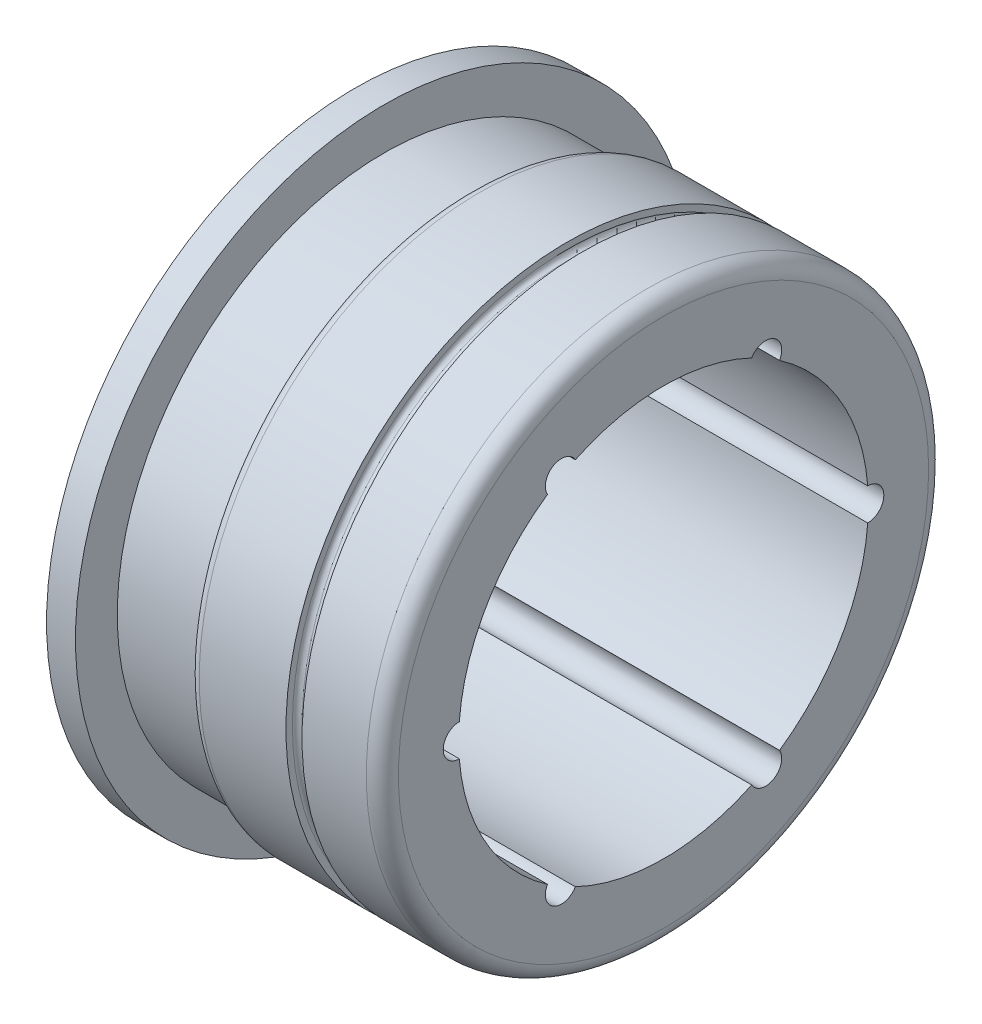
ISO-10303-21;
HEADER;
FILE_DESCRIPTION(('STEP AP214'),'2;1');
FILE_NAME('part.step','',(''),(''),'','','');
FILE_SCHEMA(('AUTOMOTIVE_DESIGN { 1 0 10303 214 1 1 1 1 }'));
ENDSEC;
DATA;
#1=APPLICATION_CONTEXT('core data for automotive mechanical design processes');
#2=APPLICATION_PROTOCOL_DEFINITION('international standard','automotive_design',2000,#1);
#3=PRODUCT_CONTEXT('',#1,'mechanical');
#4=PRODUCT('Part','Part','',(#3));
#5=PRODUCT_RELATED_PRODUCT_CATEGORY('part','',(#4));
#6=PRODUCT_DEFINITION_FORMATION('','',#4);
#7=PRODUCT_DEFINITION_CONTEXT('part definition',#1,'design');
#8=PRODUCT_DEFINITION('design','',#6,#7);
#9=PRODUCT_DEFINITION_SHAPE('','',#8);
#10=(LENGTH_UNIT() NAMED_UNIT(*) SI_UNIT(.MILLI.,.METRE.));
#11=(NAMED_UNIT(*) PLANE_ANGLE_UNIT() SI_UNIT($,.RADIAN.));
#12=(NAMED_UNIT(*) SI_UNIT($,.STERADIAN.) SOLID_ANGLE_UNIT());
#13=UNCERTAINTY_MEASURE_WITH_UNIT(LENGTH_MEASURE(1.E-05),#10,'distance_accuracy_value','');
#14=(GEOMETRIC_REPRESENTATION_CONTEXT(3) GLOBAL_UNCERTAINTY_ASSIGNED_CONTEXT((#13)) GLOBAL_UNIT_ASSIGNED_CONTEXT((#10,
#11,#12)) REPRESENTATION_CONTEXT('',''));
#15=CARTESIAN_POINT('',(0.,0.,0.));
#16=DIRECTION('',(0.,0.,1.));
#17=DIRECTION('',(1.,0.,0.));
#18=AXIS2_PLACEMENT_3D('',#15,#16,#17);
#19=CARTESIAN_POINT('',(71.,0.,0.));
#20=DIRECTION('',(1.,0.,0.));
#21=DIRECTION('',(0.,0.,-1.));
#22=AXIS2_PLACEMENT_3D('',#19,#20,#21);
#23=CYLINDRICAL_SURFACE('',#22,12.75);
#24=DIRECTION('',(-1.,0.,0.));
#25=VECTOR('',#24,1.);
#26=CARTESIAN_POINT('',(34.,11.5078097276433,5.48933650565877));
#27=LINE('',#26,#25);
#28=CARTESIAN_POINT('',(34.,11.5078097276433,5.48933650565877));
#29=VERTEX_POINT('',#28);
#30=CARTESIAN_POINT('',(14.8,11.5078097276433,5.48933650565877));
#31=VERTEX_POINT('',#30);
#32=EDGE_CURVE('E44',#29,#31,#27,.T.);
#33=ORIENTED_EDGE('',*,*,#32,.T.);
#34=CARTESIAN_POINT('',(14.8,0.,0.));
#35=DIRECTION('',(1.,0.,0.));
#36=DIRECTION('',(0.,0.,-1.));
#37=AXIS2_PLACEMENT_3D('',#34,#35,#36);
#38=CIRCLE('',#37,12.75);
#39=CARTESIAN_POINT('',(14.8,11.5078097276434,-5.48933650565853));
#40=VERTEX_POINT('',#39);
#41=EDGE_CURVE('E134',#40,#31,#38,.T.);
#42=ORIENTED_EDGE('',*,*,#41,.F.);
#43=DIRECTION('',(-1.,0.,0.));
#44=VECTOR('',#43,1.);
#45=CARTESIAN_POINT('',(34.,11.5078097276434,-5.48933650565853));
#46=LINE('',#45,#44);
#47=CARTESIAN_POINT('',(34.,11.5078097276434,-5.48933650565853));
#48=VERTEX_POINT('',#47);
#49=EDGE_CURVE('E173',#48,#40,#46,.T.);
#50=ORIENTED_EDGE('',*,*,#49,.F.);
#51=CARTESIAN_POINT('',(34.,0.,0.));
#52=DIRECTION('',(1.,0.,0.));
#53=DIRECTION('',(0.,0.,-1.));
#54=AXIS2_PLACEMENT_3D('',#51,#52,#53);
#55=CIRCLE('',#54,12.75);
#56=EDGE_CURVE('E250',#48,#29,#55,.T.);
#57=ORIENTED_EDGE('',*,*,#56,.T.);
#58=EDGE_LOOP('',(#33,#42,#50,#57));
#59=FACE_BOUND('',#58,.T.);
#60=ADVANCED_FACE('F29',(#59),#23,.F.);
#61=DIRECTION('',(-1.,0.,0.));
#62=VECTOR('',#61,1.);
#63=CARTESIAN_POINT('',(34.,10.5078097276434,-7.22138731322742));
#64=LINE('',#63,#62);
#65=CARTESIAN_POINT('',(34.,10.5078097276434,-7.22138731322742));
#66=VERTEX_POINT('',#65);
#67=CARTESIAN_POINT('',(14.8,10.5078097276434,-7.22138731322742));
#68=VERTEX_POINT('',#67);
#69=EDGE_CURVE('E52',#66,#68,#64,.T.);
#70=ORIENTED_EDGE('',*,*,#69,.T.);
#71=CARTESIAN_POINT('',(14.8,1.00000000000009,-12.7107238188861));
#72=VERTEX_POINT('',#71);
#73=EDGE_CURVE('E143',#72,#68,#38,.T.);
#74=ORIENTED_EDGE('',*,*,#73,.F.);
#75=DIRECTION('',(-1.,0.,0.));
#76=VECTOR('',#75,1.);
#77=CARTESIAN_POINT('',(34.,1.00000000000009,-12.7107238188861));
#78=LINE('',#77,#76);
#79=CARTESIAN_POINT('',(34.,1.00000000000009,-12.7107238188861));
#80=VERTEX_POINT('',#79);
#81=EDGE_CURVE('E170',#80,#72,#78,.T.);
#82=ORIENTED_EDGE('',*,*,#81,.F.);
#83=EDGE_CURVE('E172',#80,#66,#55,.T.);
#84=ORIENTED_EDGE('',*,*,#83,.T.);
#85=EDGE_LOOP('',(#70,#74,#82,#84));
#86=FACE_BOUND('',#85,.T.);
#87=ADVANCED_FACE('F168',(#86),#23,.F.);
#88=DIRECTION('',(-1.,0.,0.));
#89=VECTOR('',#88,1.);
#90=CARTESIAN_POINT('',(34.,-0.999999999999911,-12.7107238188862));
#91=LINE('',#90,#89);
#92=CARTESIAN_POINT('',(34.,-0.99999999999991,-12.7107238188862));
#93=VERTEX_POINT('',#92);
#94=CARTESIAN_POINT('',(14.8,-0.999999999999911,-12.7107238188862));
#95=VERTEX_POINT('',#94);
#96=EDGE_CURVE('E184',#93,#95,#91,.T.);
#97=ORIENTED_EDGE('',*,*,#96,.T.);
#98=CARTESIAN_POINT('',(14.8,-10.5078097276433,-7.22138731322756));
#99=VERTEX_POINT('',#98);
#100=EDGE_CURVE('E156',#99,#95,#38,.T.);
#101=ORIENTED_EDGE('',*,*,#100,.F.);
#102=DIRECTION('',(-1.,0.,0.));
#103=VECTOR('',#102,1.);
#104=CARTESIAN_POINT('',(34.,-10.5078097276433,-7.22138731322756));
#105=LINE('',#104,#103);
#106=CARTESIAN_POINT('',(34.,-10.5078097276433,-7.22138731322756));
#107=VERTEX_POINT('',#106);
#108=EDGE_CURVE('E193',#107,#99,#105,.T.);
#109=ORIENTED_EDGE('',*,*,#108,.F.);
#110=EDGE_CURVE('E255',#107,#93,#55,.T.);
#111=ORIENTED_EDGE('',*,*,#110,.T.);
#112=EDGE_LOOP('',(#97,#101,#109,#111));
#113=FACE_BOUND('',#112,.T.);
#114=ADVANCED_FACE('F270',(#113),#23,.F.);
#115=DIRECTION('',(-1.,0.,0.));
#116=VECTOR('',#115,1.);
#117=CARTESIAN_POINT('',(34.,-11.5078097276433,-5.48933650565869));
#118=LINE('',#117,#116);
#119=CARTESIAN_POINT('',(34.,-11.5078097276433,-5.48933650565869));
#120=VERTEX_POINT('',#119);
#121=CARTESIAN_POINT('',(14.8,-11.5078097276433,-5.48933650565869));
#122=VERTEX_POINT('',#121);
#123=EDGE_CURVE('E194',#120,#122,#118,.T.);
#124=ORIENTED_EDGE('',*,*,#123,.T.);
#125=CARTESIAN_POINT('',(14.8,-11.5078097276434,5.48933650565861));
#126=VERTEX_POINT('',#125);
#127=EDGE_CURVE('E151',#126,#122,#38,.T.);
#128=ORIENTED_EDGE('',*,*,#127,.F.);
#129=DIRECTION('',(-1.,0.,0.));
#130=VECTOR('',#129,1.);
#131=CARTESIAN_POINT('',(34.,-11.5078097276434,5.48933650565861));
#132=LINE('',#131,#130);
#133=CARTESIAN_POINT('',(34.,-11.5078097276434,5.48933650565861));
#134=VERTEX_POINT('',#133);
#135=EDGE_CURVE('E203',#134,#126,#132,.T.);
#136=ORIENTED_EDGE('',*,*,#135,.F.);
#137=EDGE_CURVE('E145',#134,#120,#55,.T.);
#138=ORIENTED_EDGE('',*,*,#137,.T.);
#139=EDGE_LOOP('',(#124,#128,#136,#138));
#140=FACE_BOUND('',#139,.T.);
#141=ADVANCED_FACE('F264',(#140),#23,.F.);
#142=DIRECTION('',(-1.,0.,0.));
#143=VECTOR('',#142,1.);
#144=CARTESIAN_POINT('',(34.,-10.5078097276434,7.22138731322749));
#145=LINE('',#144,#143);
#146=CARTESIAN_POINT('',(34.,-10.5078097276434,7.22138731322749));
#147=VERTEX_POINT('',#146);
#148=CARTESIAN_POINT('',(14.8,-10.5078097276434,7.22138731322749));
#149=VERTEX_POINT('',#148);
#150=EDGE_CURVE('E204',#147,#149,#145,.T.);
#151=ORIENTED_EDGE('',*,*,#150,.T.);
#152=CARTESIAN_POINT('',(14.8,-1.,12.7107238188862));
#153=VERTEX_POINT('',#152);
#154=EDGE_CURVE('E142',#153,#149,#38,.T.);
#155=ORIENTED_EDGE('',*,*,#154,.F.);
#156=DIRECTION('',(-1.,0.,0.));
#157=VECTOR('',#156,1.);
#158=CARTESIAN_POINT('',(34.,-1.,12.7107238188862));
#159=LINE('',#158,#157);
#160=CARTESIAN_POINT('',(34.,-1.,12.7107238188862));
#161=VERTEX_POINT('',#160);
#162=EDGE_CURVE('E213',#161,#153,#159,.T.);
#163=ORIENTED_EDGE('',*,*,#162,.F.);
#164=EDGE_CURVE('E140',#161,#147,#55,.T.);
#165=ORIENTED_EDGE('',*,*,#164,.T.);
#166=EDGE_LOOP('',(#151,#155,#163,#165));
#167=FACE_BOUND('',#166,.T.);
#168=ADVANCED_FACE('F279',(#167),#23,.F.);
#169=CARTESIAN_POINT('',(71.,0.,0.));
#170=DIRECTION('',(1.,0.,0.));
#171=DIRECTION('',(0.,0.,-1.));
#172=AXIS2_PLACEMENT_3D('',#169,#170,#171);
#173=CYLINDRICAL_SURFACE('',#172,16.6);
#174=CARTESIAN_POINT('',(16.6,0.,0.));
#175=DIRECTION('',(1.,0.,0.));
#176=DIRECTION('',(0.,0.,-1.));
#177=AXIS2_PLACEMENT_3D('',#174,#175,#176);
#178=CIRCLE('',#177,16.6);
#179=CARTESIAN_POINT('',(16.6,0.,-16.6));
#180=VERTEX_POINT('',#179);
#181=EDGE_CURVE('E11',#180,#180,#178,.T.);
#182=ORIENTED_EDGE('',*,*,#181,.T.);
#183=EDGE_LOOP('',(#182));
#184=FACE_BOUND('',#183,.T.);
#185=CARTESIAN_POINT('',(22.,0.,0.));
#186=DIRECTION('',(1.,0.,0.));
#187=DIRECTION('',(0.,0.,-1.));
#188=AXIS2_PLACEMENT_3D('',#185,#186,#187);
#189=CIRCLE('',#188,16.6);
#190=CARTESIAN_POINT('',(22.,0.,-16.6));
#191=VERTEX_POINT('',#190);
#192=EDGE_CURVE('E215',#191,#191,#189,.T.);
#193=ORIENTED_EDGE('',*,*,#192,.F.);
#194=EDGE_LOOP('',(#193));
#195=FACE_BOUND('',#194,.T.);
#196=ADVANCED_FACE('F31',(#184,#195),#173,.T.);
#197=CARTESIAN_POINT('',(16.6,16.6,0.));
#198=DIRECTION('',(1.,0.,0.));
#199=DIRECTION('',(0.,0.,-1.));
#200=AXIS2_PLACEMENT_3D('',#197,#198,#199);
#201=PLANE('',#200);
#202=CARTESIAN_POINT('',(16.6,0.,0.));
#203=DIRECTION('',(1.,0.,0.));
#204=DIRECTION('',(0.,0.,-1.));
#205=AXIS2_PLACEMENT_3D('',#202,#203,#204);
#206=CIRCLE('',#205,19.2);
#207=CARTESIAN_POINT('',(16.6,0.,-19.2));
#208=VERTEX_POINT('',#207);
#209=EDGE_CURVE('E37',#208,#208,#206,.T.);
#210=ORIENTED_EDGE('',*,*,#209,.T.);
#211=EDGE_LOOP('',(#210));
#212=FACE_BOUND('',#211,.T.);
#213=ORIENTED_EDGE('',*,*,#181,.F.);
#214=EDGE_LOOP('',(#213));
#215=FACE_BOUND('',#214,.T.);
#216=ADVANCED_FACE('F310',(#212,#215),#201,.T.);
#217=CARTESIAN_POINT('',(71.,0.,0.));
#218=DIRECTION('',(1.,0.,0.));
#219=DIRECTION('',(0.,0.,-1.));
#220=AXIS2_PLACEMENT_3D('',#217,#218,#219);
#221=CYLINDRICAL_SURFACE('',#220,19.2);
#222=CARTESIAN_POINT('',(14.8,0.,0.));
#223=DIRECTION('',(1.,0.,0.));
#224=DIRECTION('',(0.,0.,-1.));
#225=AXIS2_PLACEMENT_3D('',#222,#223,#224);
#226=CIRCLE('',#225,19.2);
#227=CARTESIAN_POINT('',(14.8,0.,-19.2));
#228=VERTEX_POINT('',#227);
#229=EDGE_CURVE('E150',#228,#228,#226,.T.);
#230=ORIENTED_EDGE('',*,*,#229,.T.);
#231=EDGE_LOOP('',(#230));
#232=FACE_BOUND('',#231,.T.);
#233=ORIENTED_EDGE('',*,*,#209,.F.);
#234=EDGE_LOOP('',(#233));
#235=FACE_BOUND('',#234,.T.);
#236=ADVANCED_FACE('F304',(#232,#235),#221,.T.);
#237=CARTESIAN_POINT('',(14.8,19.2,0.));
#238=DIRECTION('',(-1.,0.,0.));
#239=DIRECTION('',(0.,0.,1.));
#240=AXIS2_PLACEMENT_3D('',#237,#238,#239);
#241=PLANE('',#240);
#242=CARTESIAN_POINT('',(14.8,11.0078097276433,6.35536190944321));
#243=DIRECTION('',(-1.,0.,0.));
#244=DIRECTION('',(0.,0.866025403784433,0.50000000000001));
#245=AXIS2_PLACEMENT_3D('',#242,#243,#244);
#246=CIRCLE('',#245,1.);
#247=CARTESIAN_POINT('',(14.8,10.5078097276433,7.22138731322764));
#248=VERTEX_POINT('',#247);
#249=EDGE_CURVE('E119',#248,#31,#246,.T.);
#250=ORIENTED_EDGE('',*,*,#249,.F.);
#251=CARTESIAN_POINT('',(14.8,1.,12.7107238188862));
#252=VERTEX_POINT('',#251);
#253=EDGE_CURVE('E130',#248,#252,#38,.T.);
#254=ORIENTED_EDGE('',*,*,#253,.T.);
#255=CARTESIAN_POINT('',(14.8,0.,12.7107238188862));
#256=DIRECTION('',(-1.,0.,0.));
#257=DIRECTION('',(0.,0.,1.));
#258=AXIS2_PLACEMENT_3D('',#255,#256,#257);
#259=CIRCLE('',#258,1.);
#260=EDGE_CURVE('E207',#153,#252,#259,.T.);
#261=ORIENTED_EDGE('',*,*,#260,.F.);
#262=ORIENTED_EDGE('',*,*,#154,.T.);
#263=CARTESIAN_POINT('',(14.8,-11.0078097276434,6.35536190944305));
#264=DIRECTION('',(-1.,0.,0.));
#265=DIRECTION('',(0.,-0.86602540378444,0.499999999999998));
#266=AXIS2_PLACEMENT_3D('',#263,#264,#265);
#267=CIRCLE('',#266,1.);
#268=EDGE_CURVE('E197',#126,#149,#267,.T.);
#269=ORIENTED_EDGE('',*,*,#268,.F.);
#270=ORIENTED_EDGE('',*,*,#127,.T.);
#271=CARTESIAN_POINT('',(14.8,-11.0078097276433,-6.35536190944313));
#272=DIRECTION('',(-1.,0.,0.));
#273=DIRECTION('',(0.,-0.866025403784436,-0.500000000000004));
#274=AXIS2_PLACEMENT_3D('',#271,#272,#273);
#275=CIRCLE('',#274,1.);
#276=EDGE_CURVE('E187',#99,#122,#275,.T.);
#277=ORIENTED_EDGE('',*,*,#276,.F.);
#278=ORIENTED_EDGE('',*,*,#100,.T.);
#279=CARTESIAN_POINT('',(14.8,0.,-12.7107238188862));
#280=DIRECTION('',(-1.,0.,0.));
#281=DIRECTION('',(0.,0.,-1.));
#282=AXIS2_PLACEMENT_3D('',#279,#280,#281);
#283=CIRCLE('',#282,1.);
#284=EDGE_CURVE('E165',#72,#95,#283,.T.);
#285=ORIENTED_EDGE('',*,*,#284,.F.);
#286=ORIENTED_EDGE('',*,*,#73,.T.);
#287=CARTESIAN_POINT('',(14.8,11.0078097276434,-6.35536190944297));
#288=DIRECTION('',(-1.,0.,0.));
#289=DIRECTION('',(0.,0.866025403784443,-0.499999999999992));
#290=AXIS2_PLACEMENT_3D('',#287,#288,#289);
#291=CIRCLE('',#290,1.);
#292=EDGE_CURVE('E164',#40,#68,#291,.T.);
#293=ORIENTED_EDGE('',*,*,#292,.F.);
#294=ORIENTED_EDGE('',*,*,#41,.T.);
#295=EDGE_LOOP('',(#250,#254,#261,#262,#269,#270,#277,#278,#285,#286,#293,#294));
#296=FACE_BOUND('',#295,.T.);
#297=ORIENTED_EDGE('',*,*,#229,.F.);
#298=EDGE_LOOP('',(#297));
#299=FACE_BOUND('',#298,.T.);
#300=ADVANCED_FACE('F127',(#296,#299),#241,.T.);
#301=DIRECTION('',(-1.,0.,0.));
#302=VECTOR('',#301,1.);
#303=CARTESIAN_POINT('',(34.,10.5078097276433,7.22138731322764));
#304=LINE('',#303,#302);
#305=CARTESIAN_POINT('',(34.,10.5078097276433,7.22138731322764));
#306=VERTEX_POINT('',#305);
#307=EDGE_CURVE('E116',#306,#248,#304,.T.);
#308=ORIENTED_EDGE('',*,*,#307,.F.);
#309=CARTESIAN_POINT('',(34.,0.999999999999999,12.7107238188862));
#310=VERTEX_POINT('',#309);
#311=EDGE_CURVE('E147',#306,#310,#55,.T.);
#312=ORIENTED_EDGE('',*,*,#311,.T.);
#313=DIRECTION('',(-1.,0.,0.));
#314=VECTOR('',#313,1.);
#315=CARTESIAN_POINT('',(34.,1.,12.7107238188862));
#316=LINE('',#315,#314);
#317=EDGE_CURVE('E139',#310,#252,#316,.T.);
#318=ORIENTED_EDGE('',*,*,#317,.T.);
#319=ORIENTED_EDGE('',*,*,#253,.F.);
#320=EDGE_LOOP('',(#308,#312,#318,#319));
#321=FACE_BOUND('',#320,.T.);
#322=ADVANCED_FACE('F137',(#321),#23,.F.);
#323=CARTESIAN_POINT('',(34.,12.75,0.));
#324=DIRECTION('',(1.,0.,0.));
#325=DIRECTION('',(0.,0.,-1.));
#326=AXIS2_PLACEMENT_3D('',#323,#324,#325);
#327=PLANE('',#326);
#328=CARTESIAN_POINT('',(34.,11.0078097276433,6.35536190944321));
#329=DIRECTION('',(-1.,0.,0.));
#330=DIRECTION('',(0.,0.866025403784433,0.50000000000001));
#331=AXIS2_PLACEMENT_3D('',#328,#329,#330);
#332=CIRCLE('',#331,1.);
#333=EDGE_CURVE('E120',#306,#29,#332,.T.);
#334=ORIENTED_EDGE('',*,*,#333,.T.);
#335=ORIENTED_EDGE('',*,*,#56,.F.);
#336=CARTESIAN_POINT('',(34.,11.0078097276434,-6.35536190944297));
#337=DIRECTION('',(-1.,0.,0.));
#338=DIRECTION('',(0.,0.866025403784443,-0.499999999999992));
#339=AXIS2_PLACEMENT_3D('',#336,#337,#338);
#340=CIRCLE('',#339,1.);
#341=EDGE_CURVE('E177',#48,#66,#340,.T.);
#342=ORIENTED_EDGE('',*,*,#341,.T.);
#343=ORIENTED_EDGE('',*,*,#83,.F.);
#344=CARTESIAN_POINT('',(34.,0.,-12.7107238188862));
#345=DIRECTION('',(-1.,0.,0.));
#346=DIRECTION('',(0.,0.,-1.));
#347=AXIS2_PLACEMENT_3D('',#344,#345,#346);
#348=CIRCLE('',#347,1.);
#349=EDGE_CURVE('E175',#80,#93,#348,.T.);
#350=ORIENTED_EDGE('',*,*,#349,.T.);
#351=ORIENTED_EDGE('',*,*,#110,.F.);
#352=CARTESIAN_POINT('',(34.,-11.0078097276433,-6.35536190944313));
#353=DIRECTION('',(-1.,0.,0.));
#354=DIRECTION('',(0.,-0.866025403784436,-0.500000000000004));
#355=AXIS2_PLACEMENT_3D('',#352,#353,#354);
#356=CIRCLE('',#355,1.);
#357=EDGE_CURVE('E190',#107,#120,#356,.T.);
#358=ORIENTED_EDGE('',*,*,#357,.T.);
#359=ORIENTED_EDGE('',*,*,#137,.F.);
#360=CARTESIAN_POINT('',(34.,-11.0078097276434,6.35536190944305));
#361=DIRECTION('',(-1.,0.,0.));
#362=DIRECTION('',(0.,-0.86602540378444,0.499999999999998));
#363=AXIS2_PLACEMENT_3D('',#360,#361,#362);
#364=CIRCLE('',#363,1.);
#365=EDGE_CURVE('E200',#134,#147,#364,.T.);
#366=ORIENTED_EDGE('',*,*,#365,.T.);
#367=ORIENTED_EDGE('',*,*,#164,.F.);
#368=CARTESIAN_POINT('',(34.,0.,12.7107238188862));
#369=DIRECTION('',(-1.,0.,0.));
#370=DIRECTION('',(0.,0.,1.));
#371=AXIS2_PLACEMENT_3D('',#368,#369,#370);
#372=CIRCLE('',#371,1.);
#373=EDGE_CURVE('E210',#161,#310,#372,.T.);
#374=ORIENTED_EDGE('',*,*,#373,.T.);
#375=ORIENTED_EDGE('',*,*,#311,.F.);
#376=EDGE_LOOP('',(#334,#335,#342,#343,#350,#351,#358,#359,#366,#367,#374,#375));
#377=FACE_BOUND('',#376,.T.);
#378=CARTESIAN_POINT('',(34.,0.,0.));
#379=DIRECTION('',(1.,0.,0.));
#380=DIRECTION('',(0.,0.,-1.));
#381=AXIS2_PLACEMENT_3D('',#378,#379,#380);
#382=CIRCLE('',#381,16.5);
#383=CARTESIAN_POINT('',(34.,0.,-16.5));
#384=VERTEX_POINT('',#383);
#385=EDGE_CURVE('E246',#384,#384,#382,.T.);
#386=ORIENTED_EDGE('',*,*,#385,.T.);
#387=EDGE_LOOP('',(#386));
#388=FACE_BOUND('',#387,.T.);
#389=ADVANCED_FACE('F266',(#377,#388),#327,.T.);
#390=CARTESIAN_POINT('',(33.,0.,0.));
#391=DIRECTION('',(1.,0.,0.));
#392=DIRECTION('',(0.,0.,-1.));
#393=AXIS2_PLACEMENT_3D('',#390,#391,#392);
#394=TOROIDAL_SURFACE('',#393,16.5,0.999999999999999);
#395=CARTESIAN_POINT('',(33.,0.,0.));
#396=DIRECTION('',(1.,0.,0.));
#397=DIRECTION('',(0.,0.,-1.));
#398=AXIS2_PLACEMENT_3D('',#395,#396,#397);
#399=CIRCLE('',#398,17.5);
#400=CARTESIAN_POINT('',(33.,0.,-17.5));
#401=VERTEX_POINT('',#400);
#402=EDGE_CURVE('E243',#401,#401,#399,.T.);
#403=ORIENTED_EDGE('',*,*,#402,.T.);
#404=EDGE_LOOP('',(#403));
#405=FACE_BOUND('',#404,.T.);
#406=ORIENTED_EDGE('',*,*,#385,.F.);
#407=EDGE_LOOP('',(#406));
#408=FACE_BOUND('',#407,.T.);
#409=ADVANCED_FACE('F303',(#405,#408),#394,.T.);
#410=CARTESIAN_POINT('',(71.,0.,0.));
#411=DIRECTION('',(1.,0.,0.));
#412=DIRECTION('',(0.,0.,-1.));
#413=AXIS2_PLACEMENT_3D('',#410,#411,#412);
#414=CYLINDRICAL_SURFACE('',#413,17.5);
#415=CARTESIAN_POINT('',(29.,0.,0.));
#416=DIRECTION('',(1.,0.,0.));
#417=DIRECTION('',(0.,0.,-1.));
#418=AXIS2_PLACEMENT_3D('',#415,#416,#417);
#419=CIRCLE('',#418,17.5);
#420=CARTESIAN_POINT('',(29.,0.,-17.5));
#421=VERTEX_POINT('',#420);
#422=EDGE_CURVE('E240',#421,#421,#419,.T.);
#423=ORIENTED_EDGE('',*,*,#422,.T.);
#424=EDGE_LOOP('',(#423));
#425=FACE_BOUND('',#424,.T.);
#426=ORIENTED_EDGE('',*,*,#402,.F.);
#427=EDGE_LOOP('',(#426));
#428=FACE_BOUND('',#427,.T.);
#429=ADVANCED_FACE('F446',(#425,#428),#414,.T.);
#430=CARTESIAN_POINT('',(29.,17.1,0.));
#431=DIRECTION('',(-1.,0.,0.));
#432=DIRECTION('',(0.,0.,1.));
#433=AXIS2_PLACEMENT_3D('',#430,#431,#432);
#434=PLANE('',#433);
#435=CARTESIAN_POINT('',(29.,0.,0.));
#436=DIRECTION('',(1.,0.,0.));
#437=DIRECTION('',(0.,0.,-1.));
#438=AXIS2_PLACEMENT_3D('',#435,#436,#437);
#439=CIRCLE('',#438,17.1);
#440=CARTESIAN_POINT('',(29.,0.,-17.1));
#441=VERTEX_POINT('',#440);
#442=EDGE_CURVE('E237',#441,#441,#439,.T.);
#443=ORIENTED_EDGE('',*,*,#442,.T.);
#444=EDGE_LOOP('',(#443));
#445=FACE_BOUND('',#444,.T.);
#446=ORIENTED_EDGE('',*,*,#422,.F.);
#447=EDGE_LOOP('',(#446));
#448=FACE_BOUND('',#447,.T.);
#449=ADVANCED_FACE('F436',(#445,#448),#434,.T.);
#450=CARTESIAN_POINT('',(28.7,0.,0.));
#451=DIRECTION('',(1.,0.,0.));
#452=DIRECTION('',(0.,0.,-1.));
#453=AXIS2_PLACEMENT_3D('',#450,#451,#452);
#454=TOROIDAL_SURFACE('',#453,17.1,0.300000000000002);
#455=CARTESIAN_POINT('',(28.7,0.,0.));
#456=DIRECTION('',(1.,0.,0.));
#457=DIRECTION('',(0.,0.,-1.));
#458=AXIS2_PLACEMENT_3D('',#455,#456,#457);
#459=CIRCLE('',#458,16.8);
#460=CARTESIAN_POINT('',(28.7,0.,-16.8));
#461=VERTEX_POINT('',#460);
#462=EDGE_CURVE('E234',#461,#461,#459,.T.);
#463=ORIENTED_EDGE('',*,*,#462,.T.);
#464=EDGE_LOOP('',(#463));
#465=FACE_BOUND('',#464,.T.);
#466=ORIENTED_EDGE('',*,*,#442,.F.);
#467=EDGE_LOOP('',(#466));
#468=FACE_BOUND('',#467,.T.);
#469=ADVANCED_FACE('F426',(#465,#468),#454,.F.);
#470=CARTESIAN_POINT('',(71.,0.,0.));
#471=DIRECTION('',(1.,0.,0.));
#472=DIRECTION('',(0.,0.,-1.));
#473=AXIS2_PLACEMENT_3D('',#470,#471,#472);
#474=CYLINDRICAL_SURFACE('',#473,16.8);
#475=CARTESIAN_POINT('',(28.3,0.,0.));
#476=DIRECTION('',(1.,0.,0.));
#477=DIRECTION('',(0.,0.,-1.));
#478=AXIS2_PLACEMENT_3D('',#475,#476,#477);
#479=CIRCLE('',#478,16.8);
#480=CARTESIAN_POINT('',(28.3,0.,-16.8));
#481=VERTEX_POINT('',#480);
#482=EDGE_CURVE('E231',#481,#481,#479,.T.);
#483=ORIENTED_EDGE('',*,*,#482,.T.);
#484=EDGE_LOOP('',(#483));
#485=FACE_BOUND('',#484,.T.);
#486=ORIENTED_EDGE('',*,*,#462,.F.);
#487=EDGE_LOOP('',(#486));
#488=FACE_BOUND('',#487,.T.);
#489=ADVANCED_FACE('F416',(#485,#488),#474,.T.);
#490=CARTESIAN_POINT('',(28.3,0.,0.));
#491=DIRECTION('',(1.,0.,0.));
#492=DIRECTION('',(0.,0.,-1.));
#493=AXIS2_PLACEMENT_3D('',#490,#491,#492);
#494=TOROIDAL_SURFACE('',#493,17.1,0.3);
#495=CARTESIAN_POINT('',(28.,0.,0.));
#496=DIRECTION('',(1.,0.,0.));
#497=DIRECTION('',(0.,0.,-1.));
#498=AXIS2_PLACEMENT_3D('',#495,#496,#497);
#499=CIRCLE('',#498,17.1);
#500=CARTESIAN_POINT('',(28.,0.,-17.1));
#501=VERTEX_POINT('',#500);
#502=EDGE_CURVE('E228',#501,#501,#499,.T.);
#503=ORIENTED_EDGE('',*,*,#502,.T.);
#504=EDGE_LOOP('',(#503));
#505=FACE_BOUND('',#504,.T.);
#506=ORIENTED_EDGE('',*,*,#482,.F.);
#507=EDGE_LOOP('',(#506));
#508=FACE_BOUND('',#507,.T.);
#509=ADVANCED_FACE('F406',(#505,#508),#494,.F.);
#510=CARTESIAN_POINT('',(28.,17.1,0.));
#511=DIRECTION('',(1.,0.,0.));
#512=DIRECTION('',(0.,0.,-1.));
#513=AXIS2_PLACEMENT_3D('',#510,#511,#512);
#514=PLANE('',#513);
#515=CARTESIAN_POINT('',(28.,0.,0.));
#516=DIRECTION('',(1.,0.,0.));
#517=DIRECTION('',(0.,0.,-1.));
#518=AXIS2_PLACEMENT_3D('',#515,#516,#517);
#519=CIRCLE('',#518,17.5);
#520=CARTESIAN_POINT('',(28.,0.,-17.5));
#521=VERTEX_POINT('',#520);
#522=EDGE_CURVE('E225',#521,#521,#519,.T.);
#523=ORIENTED_EDGE('',*,*,#522,.T.);
#524=EDGE_LOOP('',(#523));
#525=FACE_BOUND('',#524,.T.);
#526=ORIENTED_EDGE('',*,*,#502,.F.);
#527=EDGE_LOOP('',(#526));
#528=FACE_BOUND('',#527,.T.);
#529=ADVANCED_FACE('F396',(#525,#528),#514,.T.);
#530=CARTESIAN_POINT('',(71.,0.,0.));
#531=DIRECTION('',(1.,0.,0.));
#532=DIRECTION('',(0.,0.,-1.));
#533=AXIS2_PLACEMENT_3D('',#530,#531,#532);
#534=CYLINDRICAL_SURFACE('',#533,17.5);
#535=CARTESIAN_POINT('',(22.6,0.,0.));
#536=DIRECTION('',(1.,0.,0.));
#537=DIRECTION('',(0.,0.,-1.));
#538=AXIS2_PLACEMENT_3D('',#535,#536,#537);
#539=CIRCLE('',#538,17.5);
#540=CARTESIAN_POINT('',(22.6,0.,-17.5));
#541=VERTEX_POINT('',#540);
#542=EDGE_CURVE('E222',#541,#541,#539,.T.);
#543=ORIENTED_EDGE('',*,*,#542,.T.);
#544=EDGE_LOOP('',(#543));
#545=FACE_BOUND('',#544,.T.);
#546=ORIENTED_EDGE('',*,*,#522,.F.);
#547=EDGE_LOOP('',(#546));
#548=FACE_BOUND('',#547,.T.);
#549=ADVANCED_FACE('F386',(#545,#548),#534,.T.);
#550=CARTESIAN_POINT('',(22.6,0.,0.));
#551=DIRECTION('',(1.,0.,0.));
#552=DIRECTION('',(0.,0.,-1.));
#553=AXIS2_PLACEMENT_3D('',#550,#551,#552);
#554=TOROIDAL_SURFACE('',#553,16.9,0.6);
#555=CARTESIAN_POINT('',(22.,0.,0.));
#556=DIRECTION('',(1.,0.,0.));
#557=DIRECTION('',(0.,0.,-1.));
#558=AXIS2_PLACEMENT_3D('',#555,#556,#557);
#559=CIRCLE('',#558,16.9);
#560=CARTESIAN_POINT('',(22.,0.,-16.9));
#561=VERTEX_POINT('',#560);
#562=EDGE_CURVE('E219',#561,#561,#559,.T.);
#563=ORIENTED_EDGE('',*,*,#562,.T.);
#564=EDGE_LOOP('',(#563));
#565=FACE_BOUND('',#564,.T.);
#566=ORIENTED_EDGE('',*,*,#542,.F.);
#567=EDGE_LOOP('',(#566));
#568=FACE_BOUND('',#567,.T.);
#569=ADVANCED_FACE('F376',(#565,#568),#554,.T.);
#570=CARTESIAN_POINT('',(22.,16.9,0.));
#571=DIRECTION('',(-1.,0.,0.));
#572=DIRECTION('',(0.,0.,1.));
#573=AXIS2_PLACEMENT_3D('',#570,#571,#572);
#574=PLANE('',#573);
#575=ORIENTED_EDGE('',*,*,#192,.T.);
#576=EDGE_LOOP('',(#575));
#577=FACE_BOUND('',#576,.T.);
#578=ORIENTED_EDGE('',*,*,#562,.F.);
#579=EDGE_LOOP('',(#578));
#580=FACE_BOUND('',#579,.T.);
#581=ADVANCED_FACE('F289',(#577,#580),#574,.T.);
#582=CARTESIAN_POINT('',(34.,0.,12.7107238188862));
#583=DIRECTION('',(-1.,0.,0.));
#584=DIRECTION('',(0.,0.,1.));
#585=AXIS2_PLACEMENT_3D('',#582,#583,#584);
#586=CYLINDRICAL_SURFACE('',#585,1.);
#587=ORIENTED_EDGE('',*,*,#260,.T.);
#588=ORIENTED_EDGE('',*,*,#317,.F.);
#589=ORIENTED_EDGE('',*,*,#373,.F.);
#590=ORIENTED_EDGE('',*,*,#162,.T.);
#591=EDGE_LOOP('',(#587,#588,#589,#590));
#592=FACE_BOUND('',#591,.T.);
#593=ADVANCED_FACE('F277',(#592),#586,.F.);
#594=CARTESIAN_POINT('',(34.,-11.0078097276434,6.35536190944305));
#595=DIRECTION('',(-1.,0.,0.));
#596=DIRECTION('',(0.,0.,1.));
#597=AXIS2_PLACEMENT_3D('',#594,#595,#596);
#598=CYLINDRICAL_SURFACE('',#597,1.);
#599=ORIENTED_EDGE('',*,*,#268,.T.);
#600=ORIENTED_EDGE('',*,*,#150,.F.);
#601=ORIENTED_EDGE('',*,*,#365,.F.);
#602=ORIENTED_EDGE('',*,*,#135,.T.);
#603=EDGE_LOOP('',(#599,#600,#601,#602));
#604=FACE_BOUND('',#603,.T.);
#605=ADVANCED_FACE('F281',(#604),#598,.F.);
#606=CARTESIAN_POINT('',(34.,-11.0078097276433,-6.35536190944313));
#607=DIRECTION('',(-1.,0.,0.));
#608=DIRECTION('',(0.,0.,1.));
#609=AXIS2_PLACEMENT_3D('',#606,#607,#608);
#610=CYLINDRICAL_SURFACE('',#609,1.);
#611=ORIENTED_EDGE('',*,*,#276,.T.);
#612=ORIENTED_EDGE('',*,*,#123,.F.);
#613=ORIENTED_EDGE('',*,*,#357,.F.);
#614=ORIENTED_EDGE('',*,*,#108,.T.);
#615=EDGE_LOOP('',(#611,#612,#613,#614));
#616=FACE_BOUND('',#615,.T.);
#617=ADVANCED_FACE('F269',(#616),#610,.F.);
#618=CARTESIAN_POINT('',(34.,0.,-12.7107238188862));
#619=DIRECTION('',(-1.,0.,0.));
#620=DIRECTION('',(0.,0.,1.));
#621=AXIS2_PLACEMENT_3D('',#618,#619,#620);
#622=CYLINDRICAL_SURFACE('',#621,1.);
#623=ORIENTED_EDGE('',*,*,#284,.T.);
#624=ORIENTED_EDGE('',*,*,#96,.F.);
#625=ORIENTED_EDGE('',*,*,#349,.F.);
#626=ORIENTED_EDGE('',*,*,#81,.T.);
#627=EDGE_LOOP('',(#623,#624,#625,#626));
#628=FACE_BOUND('',#627,.T.);
#629=ADVANCED_FACE('F272',(#628),#622,.F.);
#630=CARTESIAN_POINT('',(34.,11.0078097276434,-6.35536190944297));
#631=DIRECTION('',(-1.,0.,0.));
#632=DIRECTION('',(0.,0.,1.));
#633=AXIS2_PLACEMENT_3D('',#630,#631,#632);
#634=CYLINDRICAL_SURFACE('',#633,1.);
#635=ORIENTED_EDGE('',*,*,#292,.T.);
#636=ORIENTED_EDGE('',*,*,#69,.F.);
#637=ORIENTED_EDGE('',*,*,#341,.F.);
#638=ORIENTED_EDGE('',*,*,#49,.T.);
#639=EDGE_LOOP('',(#635,#636,#637,#638));
#640=FACE_BOUND('',#639,.T.);
#641=ADVANCED_FACE('F345',(#640),#634,.F.);
#642=CARTESIAN_POINT('',(34.,11.0078097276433,6.35536190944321));
#643=DIRECTION('',(-1.,0.,0.));
#644=DIRECTION('',(0.,0.,1.));
#645=AXIS2_PLACEMENT_3D('',#642,#643,#644);
#646=CYLINDRICAL_SURFACE('',#645,1.);
#647=ORIENTED_EDGE('',*,*,#249,.T.);
#648=ORIENTED_EDGE('',*,*,#32,.F.);
#649=ORIENTED_EDGE('',*,*,#333,.F.);
#650=ORIENTED_EDGE('',*,*,#307,.T.);
#651=EDGE_LOOP('',(#647,#648,#649,#650));
#652=FACE_BOUND('',#651,.T.);
#653=ADVANCED_FACE('F118',(#652),#646,.F.);
#654=CLOSED_SHELL('',(#60,#87,#114,#141,#168,#196,#216,#236,#300,#322,#389,#409,#429,#449,#469,
#489,#509,#529,#549,#569,#581,#593,#605,#617,#629,#641,#653));
#655=MANIFOLD_SOLID_BREP('B2',#654);
#656=ADVANCED_BREP_SHAPE_REPRESENTATION('',(#18,#655),#14);
#657=SHAPE_DEFINITION_REPRESENTATION(#9,#656);
ENDSEC;
END-ISO-10303-21;
